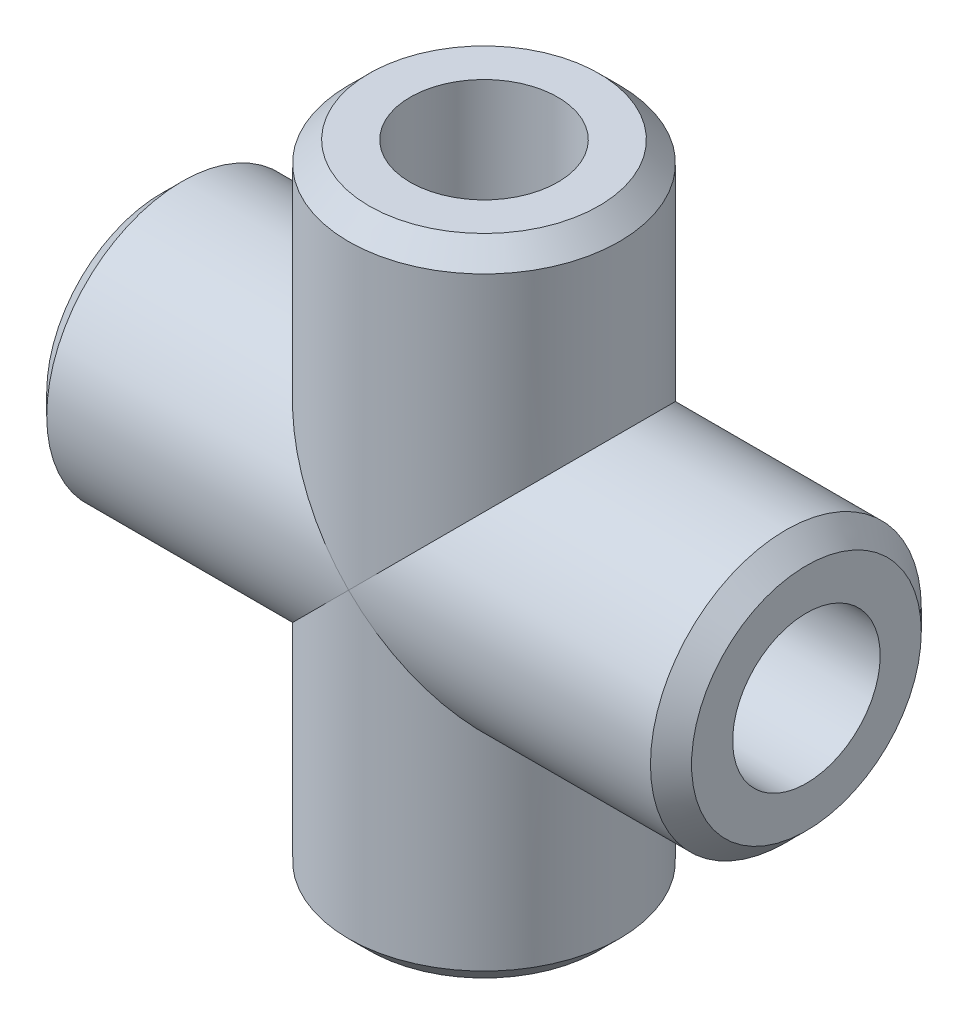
ISO-10303-21;
HEADER;
FILE_DESCRIPTION(('STEP AP214'),'2;1');
FILE_NAME('part.step','',(''),(''),'','','');
FILE_SCHEMA(('AUTOMOTIVE_DESIGN { 1 0 10303 214 1 1 1 1 }'));
ENDSEC;
DATA;
#1=APPLICATION_CONTEXT('core data for automotive mechanical design processes');
#2=APPLICATION_PROTOCOL_DEFINITION('international standard','automotive_design',2000,#1);
#3=PRODUCT_CONTEXT('',#1,'mechanical');
#4=PRODUCT('Part','Part','',(#3));
#5=PRODUCT_RELATED_PRODUCT_CATEGORY('part','',(#4));
#6=PRODUCT_DEFINITION_FORMATION('','',#4);
#7=PRODUCT_DEFINITION_CONTEXT('part definition',#1,'design');
#8=PRODUCT_DEFINITION('design','',#6,#7);
#9=PRODUCT_DEFINITION_SHAPE('','',#8);
#10=(LENGTH_UNIT() NAMED_UNIT(*) SI_UNIT(.MILLI.,.METRE.));
#11=(NAMED_UNIT(*) PLANE_ANGLE_UNIT() SI_UNIT($,.RADIAN.));
#12=(NAMED_UNIT(*) SI_UNIT($,.STERADIAN.) SOLID_ANGLE_UNIT());
#13=UNCERTAINTY_MEASURE_WITH_UNIT(LENGTH_MEASURE(1.E-05),#10,'distance_accuracy_value','');
#14=(GEOMETRIC_REPRESENTATION_CONTEXT(3) GLOBAL_UNCERTAINTY_ASSIGNED_CONTEXT((#13)) GLOBAL_UNIT_ASSIGNED_CONTEXT((#10,
#11,#12)) REPRESENTATION_CONTEXT('',''));
#15=CARTESIAN_POINT('',(0.,0.,0.));
#16=DIRECTION('',(0.,0.,1.));
#17=DIRECTION('',(1.,0.,0.));
#18=AXIS2_PLACEMENT_3D('',#15,#16,#17);
#19=CARTESIAN_POINT('',(-25.,0.,0.));
#20=DIRECTION('',(-1.,0.,0.));
#21=DIRECTION('',(0.,0.,-1.));
#22=AXIS2_PLACEMENT_3D('',#19,#20,#21);
#23=PLANE('',#22);
#24=CARTESIAN_POINT('',(-25.,0.,0.));
#25=DIRECTION('',(-1.,0.,0.));
#26=DIRECTION('',(0.,0.,1.));
#27=AXIS2_PLACEMENT_3D('',#24,#25,#26);
#28=CIRCLE('',#27,8.90666666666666);
#29=CARTESIAN_POINT('',(-25.,0.,8.90666666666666));
#30=VERTEX_POINT('',#29);
#31=EDGE_CURVE('E105',#30,#30,#28,.T.);
#32=ORIENTED_EDGE('',*,*,#31,.T.);
#33=EDGE_LOOP('',(#32));
#34=FACE_BOUND('',#33,.T.);
#35=CARTESIAN_POINT('',(-25.,0.,0.));
#36=DIRECTION('',(-1.,0.,0.));
#37=DIRECTION('',(0.,0.,1.));
#38=AXIS2_PLACEMENT_3D('',#35,#36,#37);
#39=CIRCLE('',#38,5.72000000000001);
#40=CARTESIAN_POINT('',(-25.,0.,5.72000000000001));
#41=VERTEX_POINT('',#40);
#42=EDGE_CURVE('E88',#41,#41,#39,.F.);
#43=ORIENTED_EDGE('',*,*,#42,.T.);
#44=EDGE_LOOP('',(#43));
#45=FACE_BOUND('',#44,.T.);
#46=ADVANCED_FACE('F34',(#34,#45),#23,.T.);
#47=CARTESIAN_POINT('',(0.,-25.,0.));
#48=DIRECTION('',(0.,-1.,0.));
#49=DIRECTION('',(0.,0.,1.));
#50=AXIS2_PLACEMENT_3D('',#47,#48,#49);
#51=PLANE('',#50);
#52=CARTESIAN_POINT('',(0.,-25.,0.));
#53=DIRECTION('',(0.,-1.,0.));
#54=DIRECTION('',(0.,0.,-1.));
#55=AXIS2_PLACEMENT_3D('',#52,#53,#54);
#56=CIRCLE('',#55,8.90666666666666);
#57=CARTESIAN_POINT('',(0.,-25.,-8.90666666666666));
#58=VERTEX_POINT('',#57);
#59=EDGE_CURVE('E111',#58,#58,#56,.T.);
#60=ORIENTED_EDGE('',*,*,#59,.T.);
#61=EDGE_LOOP('',(#60));
#62=FACE_BOUND('',#61,.T.);
#63=CARTESIAN_POINT('',(0.,-25.,0.));
#64=DIRECTION('',(0.,-1.,0.));
#65=DIRECTION('',(0.,0.,-1.));
#66=AXIS2_PLACEMENT_3D('',#63,#64,#65);
#67=CIRCLE('',#66,5.72000000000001);
#68=CARTESIAN_POINT('',(0.,-25.,-5.72000000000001));
#69=VERTEX_POINT('',#68);
#70=EDGE_CURVE('E81',#69,#69,#67,.F.);
#71=ORIENTED_EDGE('',*,*,#70,.T.);
#72=EDGE_LOOP('',(#71));
#73=FACE_BOUND('',#72,.T.);
#74=ADVANCED_FACE('F138',(#62,#73),#51,.T.);
#75=CARTESIAN_POINT('',(25.,0.,0.));
#76=DIRECTION('',(-1.,0.,0.));
#77=DIRECTION('',(0.,0.,1.));
#78=AXIS2_PLACEMENT_3D('',#75,#76,#77);
#79=CYLINDRICAL_SURFACE('',#78,10.5);
#80=CARTESIAN_POINT('',(-23.4066666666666,0.,0.));
#81=DIRECTION('',(-1.,0.,0.));
#82=DIRECTION('',(0.,0.,1.));
#83=AXIS2_PLACEMENT_3D('',#80,#81,#82);
#84=CIRCLE('',#83,10.5);
#85=CARTESIAN_POINT('',(-23.4066666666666,0.,10.5));
#86=VERTEX_POINT('',#85);
#87=EDGE_CURVE('E102',#86,#86,#84,.F.);
#88=ORIENTED_EDGE('',*,*,#87,.T.);
#89=EDGE_LOOP('',(#88));
#90=FACE_BOUND('',#89,.T.);
#91=CARTESIAN_POINT('',(0.,0.,0.));
#92=DIRECTION('',(0.707106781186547,-0.707106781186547,0.));
#93=DIRECTION('',(-0.707106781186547,-0.707106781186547,0.));
#94=AXIS2_PLACEMENT_3D('',#91,#92,#93);
#95=ELLIPSE('',#94,14.8492424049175,10.5);
#96=CARTESIAN_POINT('',(0.,0.,-10.5));
#97=VERTEX_POINT('',#96);
#98=CARTESIAN_POINT('',(0.,0.,10.5));
#99=VERTEX_POINT('',#98);
#100=EDGE_CURVE('E96',#97,#99,#95,.F.);
#101=ORIENTED_EDGE('',*,*,#100,.T.);
#102=CARTESIAN_POINT('',(0.,0.,0.));
#103=DIRECTION('',(-0.707106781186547,-0.707106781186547,0.));
#104=DIRECTION('',(-0.707106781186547,0.707106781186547,0.));
#105=AXIS2_PLACEMENT_3D('',#102,#103,#104);
#106=ELLIPSE('',#105,14.8492424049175,10.5);
#107=EDGE_CURVE('E54',#97,#99,#106,.F.);
#108=ORIENTED_EDGE('',*,*,#107,.F.);
#109=EDGE_LOOP('',(#101,#108));
#110=FACE_BOUND('',#109,.T.);
#111=ADVANCED_FACE('F36',(#90,#110),#79,.T.);
#112=CARTESIAN_POINT('',(23.4066666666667,0.,0.));
#113=DIRECTION('',(1.,0.,0.));
#114=DIRECTION('',(0.,0.,-1.));
#115=AXIS2_PLACEMENT_3D('',#112,#113,#114);
#116=CIRCLE('',#115,10.5);
#117=CARTESIAN_POINT('',(23.4066666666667,0.,-10.5));
#118=VERTEX_POINT('',#117);
#119=EDGE_CURVE('E117',#118,#118,#116,.F.);
#120=ORIENTED_EDGE('',*,*,#119,.T.);
#121=EDGE_LOOP('',(#120));
#122=FACE_BOUND('',#121,.T.);
#123=CARTESIAN_POINT('',(0.,0.,0.));
#124=DIRECTION('',(0.707106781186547,0.707106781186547,0.));
#125=DIRECTION('',(-0.707106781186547,0.707106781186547,0.));
#126=AXIS2_PLACEMENT_3D('',#123,#124,#125);
#127=ELLIPSE('',#126,14.8492424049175,10.5);
#128=EDGE_CURVE('E48',#99,#97,#127,.T.);
#129=ORIENTED_EDGE('',*,*,#128,.T.);
#130=CARTESIAN_POINT('',(0.,0.,0.));
#131=DIRECTION('',(-0.707106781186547,0.707106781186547,0.));
#132=DIRECTION('',(-0.707106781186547,-0.707106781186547,0.));
#133=AXIS2_PLACEMENT_3D('',#130,#131,#132);
#134=ELLIPSE('',#133,14.8492424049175,10.5);
#135=EDGE_CURVE('E99',#99,#97,#134,.T.);
#136=ORIENTED_EDGE('',*,*,#135,.F.);
#137=EDGE_LOOP('',(#129,#136));
#138=FACE_BOUND('',#137,.T.);
#139=ADVANCED_FACE('F152',(#122,#138),#79,.T.);
#140=CARTESIAN_POINT('',(25.,0.,0.));
#141=DIRECTION('',(1.,0.,0.));
#142=DIRECTION('',(0.,0.,-1.));
#143=AXIS2_PLACEMENT_3D('',#140,#141,#142);
#144=PLANE('',#143);
#145=CARTESIAN_POINT('',(25.,0.,0.));
#146=DIRECTION('',(1.,0.,0.));
#147=DIRECTION('',(0.,0.,-1.));
#148=AXIS2_PLACEMENT_3D('',#145,#146,#147);
#149=CIRCLE('',#148,8.90666666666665);
#150=CARTESIAN_POINT('',(25.,0.,-8.90666666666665));
#151=VERTEX_POINT('',#150);
#152=EDGE_CURVE('E114',#151,#151,#149,.T.);
#153=ORIENTED_EDGE('',*,*,#152,.T.);
#154=EDGE_LOOP('',(#153));
#155=FACE_BOUND('',#154,.T.);
#156=CARTESIAN_POINT('',(25.,0.,0.));
#157=DIRECTION('',(1.,0.,0.));
#158=DIRECTION('',(0.,0.,-1.));
#159=AXIS2_PLACEMENT_3D('',#156,#157,#158);
#160=CIRCLE('',#159,5.72000000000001);
#161=CARTESIAN_POINT('',(25.,0.,-5.72000000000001));
#162=VERTEX_POINT('',#161);
#163=EDGE_CURVE('E75',#162,#162,#160,.T.);
#164=ORIENTED_EDGE('',*,*,#163,.F.);
#165=EDGE_LOOP('',(#164));
#166=FACE_BOUND('',#165,.T.);
#167=ADVANCED_FACE('F150',(#155,#166),#144,.T.);
#168=CARTESIAN_POINT('',(0.,25.,0.));
#169=DIRECTION('',(0.,-1.,0.));
#170=DIRECTION('',(0.,0.,-1.));
#171=AXIS2_PLACEMENT_3D('',#168,#169,#170);
#172=CYLINDRICAL_SURFACE('',#171,10.5);
#173=CARTESIAN_POINT('',(0.,23.4066666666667,0.));
#174=DIRECTION('',(0.,1.,0.));
#175=DIRECTION('',(0.,0.,1.));
#176=AXIS2_PLACEMENT_3D('',#173,#174,#175);
#177=CIRCLE('',#176,10.5);
#178=CARTESIAN_POINT('',(0.,23.4066666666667,10.5));
#179=VERTEX_POINT('',#178);
#180=EDGE_CURVE('E11',#179,#179,#177,.F.);
#181=ORIENTED_EDGE('',*,*,#180,.T.);
#182=EDGE_LOOP('',(#181));
#183=FACE_BOUND('',#182,.T.);
#184=ORIENTED_EDGE('',*,*,#135,.T.);
#185=ORIENTED_EDGE('',*,*,#107,.T.);
#186=EDGE_LOOP('',(#184,#185));
#187=FACE_BOUND('',#186,.T.);
#188=ADVANCED_FACE('F148',(#183,#187),#172,.T.);
#189=CARTESIAN_POINT('',(0.,25.,0.));
#190=DIRECTION('',(0.,1.,0.));
#191=DIRECTION('',(0.,0.,1.));
#192=AXIS2_PLACEMENT_3D('',#189,#190,#191);
#193=PLANE('',#192);
#194=CARTESIAN_POINT('',(0.,25.,0.));
#195=DIRECTION('',(0.,1.,0.));
#196=DIRECTION('',(0.,0.,1.));
#197=AXIS2_PLACEMENT_3D('',#194,#195,#196);
#198=CIRCLE('',#197,8.90666666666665);
#199=CARTESIAN_POINT('',(0.,25.,8.90666666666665));
#200=VERTEX_POINT('',#199);
#201=EDGE_CURVE('E42',#200,#200,#198,.T.);
#202=ORIENTED_EDGE('',*,*,#201,.T.);
#203=EDGE_LOOP('',(#202));
#204=FACE_BOUND('',#203,.T.);
#205=CARTESIAN_POINT('',(0.,25.,0.));
#206=DIRECTION('',(0.,1.,0.));
#207=DIRECTION('',(0.,0.,1.));
#208=AXIS2_PLACEMENT_3D('',#205,#206,#207);
#209=CIRCLE('',#208,5.72000000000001);
#210=CARTESIAN_POINT('',(0.,25.,5.72000000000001));
#211=VERTEX_POINT('',#210);
#212=EDGE_CURVE('E80',#211,#211,#209,.T.);
#213=ORIENTED_EDGE('',*,*,#212,.F.);
#214=EDGE_LOOP('',(#213));
#215=FACE_BOUND('',#214,.T.);
#216=ADVANCED_FACE('F122',(#204,#215),#193,.T.);
#217=CARTESIAN_POINT('',(0.,-25.,0.));
#218=DIRECTION('',(0.,1.,0.));
#219=DIRECTION('',(0.,0.,-1.));
#220=AXIS2_PLACEMENT_3D('',#217,#218,#219);
#221=CYLINDRICAL_SURFACE('',#220,10.5);
#222=CARTESIAN_POINT('',(0.,-23.4066666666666,0.));
#223=DIRECTION('',(0.,-1.,0.));
#224=DIRECTION('',(0.,0.,-1.));
#225=AXIS2_PLACEMENT_3D('',#222,#223,#224);
#226=CIRCLE('',#225,10.5);
#227=CARTESIAN_POINT('',(0.,-23.4066666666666,-10.5));
#228=VERTEX_POINT('',#227);
#229=EDGE_CURVE('E108',#228,#228,#226,.F.);
#230=ORIENTED_EDGE('',*,*,#229,.T.);
#231=EDGE_LOOP('',(#230));
#232=FACE_BOUND('',#231,.T.);
#233=ORIENTED_EDGE('',*,*,#128,.F.);
#234=ORIENTED_EDGE('',*,*,#100,.F.);
#235=EDGE_LOOP('',(#233,#234));
#236=FACE_BOUND('',#235,.T.);
#237=ADVANCED_FACE('F172',(#232,#236),#221,.T.);
#238=CARTESIAN_POINT('',(25.,0.,0.));
#239=DIRECTION('',(-1.,0.,0.));
#240=DIRECTION('',(0.,0.,1.));
#241=AXIS2_PLACEMENT_3D('',#238,#239,#240);
#242=CYLINDRICAL_SURFACE('',#241,5.72000000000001);
#243=ORIENTED_EDGE('',*,*,#42,.F.);
#244=EDGE_LOOP('',(#243));
#245=FACE_BOUND('',#244,.T.);
#246=CARTESIAN_POINT('',(0.,0.,0.));
#247=DIRECTION('',(-0.707106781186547,0.707106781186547,0.));
#248=DIRECTION('',(0.707106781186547,0.707106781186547,0.));
#249=AXIS2_PLACEMENT_3D('',#246,#247,#248);
#250=ELLIPSE('',#249,8.08930157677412,5.72000000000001);
#251=CARTESIAN_POINT('',(0.,0.,-5.72000000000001));
#252=VERTEX_POINT('',#251);
#253=CARTESIAN_POINT('',(0.,0.,5.72000000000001));
#254=VERTEX_POINT('',#253);
#255=EDGE_CURVE('E67',#252,#254,#250,.T.);
#256=ORIENTED_EDGE('',*,*,#255,.F.);
#257=CARTESIAN_POINT('',(0.,0.,0.));
#258=DIRECTION('',(-0.707106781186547,-0.707106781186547,0.));
#259=DIRECTION('',(-0.707106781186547,0.707106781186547,0.));
#260=AXIS2_PLACEMENT_3D('',#257,#258,#259);
#261=ELLIPSE('',#260,8.08930157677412,5.72000000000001);
#262=EDGE_CURVE('E63',#252,#254,#261,.F.);
#263=ORIENTED_EDGE('',*,*,#262,.T.);
#264=EDGE_LOOP('',(#256,#263));
#265=FACE_BOUND('',#264,.T.);
#266=ADVANCED_FACE('F65',(#245,#265),#242,.F.);
#267=ORIENTED_EDGE('',*,*,#163,.T.);
#268=EDGE_LOOP('',(#267));
#269=FACE_BOUND('',#268,.T.);
#270=CARTESIAN_POINT('',(0.,0.,0.));
#271=DIRECTION('',(0.707106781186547,0.707106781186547,0.));
#272=DIRECTION('',(-0.707106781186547,0.707106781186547,0.));
#273=AXIS2_PLACEMENT_3D('',#270,#271,#272);
#274=ELLIPSE('',#273,8.08930157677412,5.72000000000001);
#275=EDGE_CURVE('E79',#254,#252,#274,.T.);
#276=ORIENTED_EDGE('',*,*,#275,.F.);
#277=CARTESIAN_POINT('',(0.,0.,0.));
#278=DIRECTION('',(-0.707106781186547,0.707106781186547,0.));
#279=DIRECTION('',(-0.707106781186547,-0.707106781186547,0.));
#280=AXIS2_PLACEMENT_3D('',#277,#278,#279);
#281=ELLIPSE('',#280,8.08930157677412,5.72000000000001);
#282=EDGE_CURVE('E70',#254,#252,#281,.T.);
#283=ORIENTED_EDGE('',*,*,#282,.T.);
#284=EDGE_LOOP('',(#276,#283));
#285=FACE_BOUND('',#284,.T.);
#286=ADVANCED_FACE('F83',(#269,#285),#242,.F.);
#287=CARTESIAN_POINT('',(0.,25.,0.));
#288=DIRECTION('',(0.,-1.,0.));
#289=DIRECTION('',(0.,0.,-1.));
#290=AXIS2_PLACEMENT_3D('',#287,#288,#289);
#291=CYLINDRICAL_SURFACE('',#290,5.72000000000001);
#292=ORIENTED_EDGE('',*,*,#212,.T.);
#293=EDGE_LOOP('',(#292));
#294=FACE_BOUND('',#293,.T.);
#295=ORIENTED_EDGE('',*,*,#282,.F.);
#296=ORIENTED_EDGE('',*,*,#262,.F.);
#297=EDGE_LOOP('',(#295,#296));
#298=FACE_BOUND('',#297,.T.);
#299=ADVANCED_FACE('F72',(#294,#298),#291,.F.);
#300=CARTESIAN_POINT('',(0.,-25.,0.));
#301=DIRECTION('',(0.,1.,0.));
#302=DIRECTION('',(0.,0.,-1.));
#303=AXIS2_PLACEMENT_3D('',#300,#301,#302);
#304=CYLINDRICAL_SURFACE('',#303,5.72000000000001);
#305=ORIENTED_EDGE('',*,*,#70,.F.);
#306=EDGE_LOOP('',(#305));
#307=FACE_BOUND('',#306,.T.);
#308=ORIENTED_EDGE('',*,*,#275,.T.);
#309=ORIENTED_EDGE('',*,*,#255,.T.);
#310=EDGE_LOOP('',(#308,#309));
#311=FACE_BOUND('',#310,.T.);
#312=ADVANCED_FACE('F78',(#307,#311),#304,.F.);
#313=CARTESIAN_POINT('',(-23.4066666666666,0.,0.));
#314=DIRECTION('',(1.,0.,0.));
#315=DIRECTION('',(0.,0.,-1.));
#316=AXIS2_PLACEMENT_3D('',#313,#314,#315);
#317=CONICAL_SURFACE('',#316,10.5,0.785398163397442);
#318=ORIENTED_EDGE('',*,*,#31,.F.);
#319=EDGE_LOOP('',(#318));
#320=FACE_BOUND('',#319,.T.);
#321=ORIENTED_EDGE('',*,*,#87,.F.);
#322=EDGE_LOOP('',(#321));
#323=FACE_BOUND('',#322,.T.);
#324=ADVANCED_FACE('F175',(#320,#323),#317,.T.);
#325=CARTESIAN_POINT('',(0.,-23.4066666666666,0.));
#326=DIRECTION('',(0.,1.,0.));
#327=DIRECTION('',(0.,0.,1.));
#328=AXIS2_PLACEMENT_3D('',#325,#326,#327);
#329=CONICAL_SURFACE('',#328,10.5,0.785398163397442);
#330=ORIENTED_EDGE('',*,*,#59,.F.);
#331=EDGE_LOOP('',(#330));
#332=FACE_BOUND('',#331,.T.);
#333=ORIENTED_EDGE('',*,*,#229,.F.);
#334=EDGE_LOOP('',(#333));
#335=FACE_BOUND('',#334,.T.);
#336=ADVANCED_FACE('F133',(#332,#335),#329,.T.);
#337=CARTESIAN_POINT('',(25.,0.,0.));
#338=DIRECTION('',(-1.,0.,0.));
#339=DIRECTION('',(0.,0.,1.));
#340=AXIS2_PLACEMENT_3D('',#337,#338,#339);
#341=CONICAL_SURFACE('',#340,8.90666666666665,0.785398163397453);
#342=ORIENTED_EDGE('',*,*,#119,.F.);
#343=EDGE_LOOP('',(#342));
#344=FACE_BOUND('',#343,.T.);
#345=ORIENTED_EDGE('',*,*,#152,.F.);
#346=EDGE_LOOP('',(#345));
#347=FACE_BOUND('',#346,.T.);
#348=ADVANCED_FACE('F127',(#344,#347),#341,.T.);
#349=CARTESIAN_POINT('',(0.,25.,0.));
#350=DIRECTION('',(0.,-1.,0.));
#351=DIRECTION('',(0.,0.,-1.));
#352=AXIS2_PLACEMENT_3D('',#349,#350,#351);
#353=CONICAL_SURFACE('',#352,8.90666666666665,0.785398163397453);
#354=ORIENTED_EDGE('',*,*,#180,.F.);
#355=EDGE_LOOP('',(#354));
#356=FACE_BOUND('',#355,.T.);
#357=ORIENTED_EDGE('',*,*,#201,.F.);
#358=EDGE_LOOP('',(#357));
#359=FACE_BOUND('',#358,.T.);
#360=ADVANCED_FACE('F125',(#356,#359),#353,.T.);
#361=CLOSED_SHELL('',(#46,#74,#111,#139,#167,#188,#216,#237,#266,#286,#299,#312,#324,#336,#348,#360));
#362=MANIFOLD_SOLID_BREP('B2',#361);
#363=ADVANCED_BREP_SHAPE_REPRESENTATION('',(#18,#362),#14);
#364=SHAPE_DEFINITION_REPRESENTATION(#9,#363);
ENDSEC;
END-ISO-10303-21;
